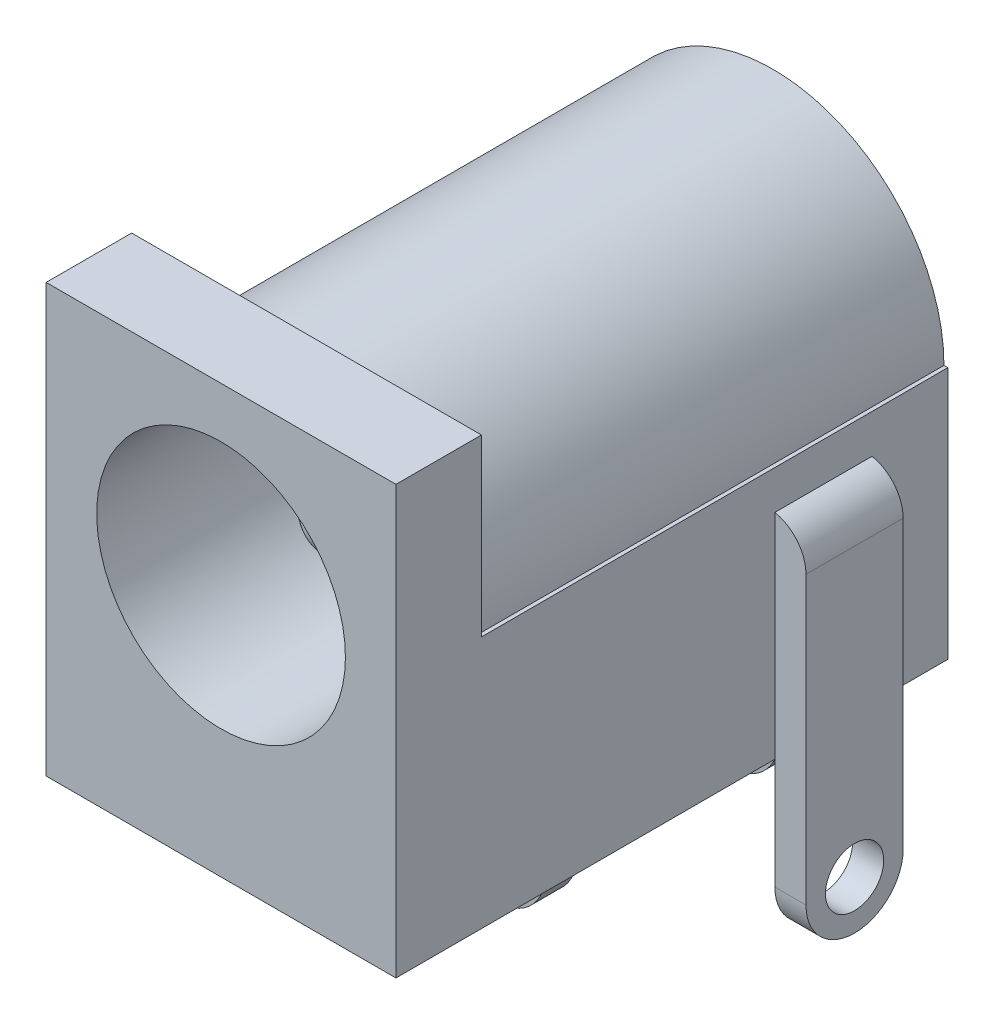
ISO-10303-21;
HEADER;
FILE_DESCRIPTION(('STEP AP214'),'2;1');
FILE_NAME('part.step','',(''),(''),'','','');
FILE_SCHEMA(('AUTOMOTIVE_DESIGN { 1 0 10303 214 1 1 1 1 }'));
ENDSEC;
DATA;
#1=APPLICATION_CONTEXT('core data for automotive mechanical design processes');
#2=APPLICATION_PROTOCOL_DEFINITION('international standard','automotive_design',2000,#1);
#3=PRODUCT_CONTEXT('',#1,'mechanical');
#4=PRODUCT('Part','Part','',(#3));
#5=PRODUCT_RELATED_PRODUCT_CATEGORY('part','',(#4));
#6=PRODUCT_DEFINITION_FORMATION('','',#4);
#7=PRODUCT_DEFINITION_CONTEXT('part definition',#1,'design');
#8=PRODUCT_DEFINITION('design','',#6,#7);
#9=PRODUCT_DEFINITION_SHAPE('','',#8);
#10=(LENGTH_UNIT() NAMED_UNIT(*) SI_UNIT(.MILLI.,.METRE.));
#11=(NAMED_UNIT(*) PLANE_ANGLE_UNIT() SI_UNIT($,.RADIAN.));
#12=(NAMED_UNIT(*) SI_UNIT($,.STERADIAN.) SOLID_ANGLE_UNIT());
#13=UNCERTAINTY_MEASURE_WITH_UNIT(LENGTH_MEASURE(1.E-05),#10,'distance_accuracy_value','');
#14=(GEOMETRIC_REPRESENTATION_CONTEXT(3) GLOBAL_UNCERTAINTY_ASSIGNED_CONTEXT((#13)) GLOBAL_UNIT_ASSIGNED_CONTEXT((#10,
#11,#12)) REPRESENTATION_CONTEXT('',''));
#15=CARTESIAN_POINT('',(0.,0.,0.));
#16=DIRECTION('',(0.,0.,1.));
#17=DIRECTION('',(1.,0.,0.));
#18=AXIS2_PLACEMENT_3D('',#15,#16,#17);
#19=CARTESIAN_POINT('',(0.,6.5,-11.2));
#20=DIRECTION('',(0.,0.,1.));
#21=DIRECTION('',(1.,0.,0.));
#22=AXIS2_PLACEMENT_3D('',#19,#20,#21);
#23=PLANE('',#22);
#24=CARTESIAN_POINT('',(0.,6.5,-11.2));
#25=DIRECTION('',(0.,0.,1.));
#26=DIRECTION('',(1.,0.,0.));
#27=AXIS2_PLACEMENT_3D('',#24,#25,#26);
#28=CIRCLE('',#27,3.2);
#29=CARTESIAN_POINT('',(3.2,6.5,-11.2));
#30=VERTEX_POINT('',#29);
#31=EDGE_CURVE('E432',#30,#30,#28,.T.);
#32=ORIENTED_EDGE('',*,*,#31,.T.);
#33=EDGE_LOOP('',(#32));
#34=FACE_BOUND('',#33,.T.);
#35=CARTESIAN_POINT('',(0.,6.5,-11.2));
#36=DIRECTION('',(0.,0.,1.));
#37=DIRECTION('',(1.,0.,0.));
#38=AXIS2_PLACEMENT_3D('',#35,#36,#37);
#39=CIRCLE('',#38,1.00555386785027);
#40=CARTESIAN_POINT('',(1.00555386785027,6.5,-11.2));
#41=VERTEX_POINT('',#40);
#42=EDGE_CURVE('E557',#41,#41,#39,.T.);
#43=ORIENTED_EDGE('',*,*,#42,.F.);
#44=EDGE_LOOP('',(#43));
#45=FACE_BOUND('',#44,.T.);
#46=ADVANCED_FACE('F39',(#34,#45),#23,.T.);
#47=CARTESIAN_POINT('',(-4.5,0.,-14.2));
#48=DIRECTION('',(0.,-1.,0.));
#49=DIRECTION('',(1.,0.,0.));
#50=AXIS2_PLACEMENT_3D('',#47,#48,#49);
#51=PLANE('',#50);
#52=DIRECTION('',(0.,0.,-1.));
#53=VECTOR('',#52,1.);
#54=CARTESIAN_POINT('',(-1.45,0.,-13.4));
#55=LINE('',#54,#53);
#56=CARTESIAN_POINT('',(-1.45,0.,-13.4));
#57=VERTEX_POINT('',#56);
#58=CARTESIAN_POINT('',(-1.45,0.,-14.2));
#59=VERTEX_POINT('',#58);
#60=EDGE_CURVE('E275',#57,#59,#55,.T.);
#61=ORIENTED_EDGE('',*,*,#60,.F.);
#62=DIRECTION('',(-1.,0.,0.));
#63=VECTOR('',#62,1.);
#64=CARTESIAN_POINT('',(0.,0.,-13.4));
#65=LINE('',#64,#63);
#66=CARTESIAN_POINT('',(-1.25,0.,-13.4));
#67=VERTEX_POINT('',#66);
#68=EDGE_CURVE('E540',#67,#57,#65,.T.);
#69=ORIENTED_EDGE('',*,*,#68,.F.);
#70=DIRECTION('',(0.,0.,1.));
#71=VECTOR('',#70,1.);
#72=CARTESIAN_POINT('',(-1.25,0.,-14.2));
#73=LINE('',#72,#71);
#74=CARTESIAN_POINT('',(-1.25,0.,-13.1));
#75=VERTEX_POINT('',#74);
#76=EDGE_CURVE('E64',#67,#75,#73,.T.);
#77=ORIENTED_EDGE('',*,*,#76,.T.);
#78=DIRECTION('',(-1.,0.,0.));
#79=VECTOR('',#78,1.);
#80=CARTESIAN_POINT('',(-4.5,0.,-13.1));
#81=LINE('',#80,#79);
#82=CARTESIAN_POINT('',(1.25,0.,-13.1));
#83=VERTEX_POINT('',#82);
#84=EDGE_CURVE('E49',#83,#75,#81,.T.);
#85=ORIENTED_EDGE('',*,*,#84,.F.);
#86=DIRECTION('',(0.,0.,-1.));
#87=VECTOR('',#86,1.);
#88=CARTESIAN_POINT('',(1.25,0.,-14.2));
#89=LINE('',#88,#87);
#90=CARTESIAN_POINT('',(1.25,0.,-13.4));
#91=VERTEX_POINT('',#90);
#92=EDGE_CURVE('E11',#83,#91,#89,.T.);
#93=ORIENTED_EDGE('',*,*,#92,.T.);
#94=CARTESIAN_POINT('',(1.45,0.,-13.4));
#95=VERTEX_POINT('',#94);
#96=EDGE_CURVE('E529',#95,#91,#65,.T.);
#97=ORIENTED_EDGE('',*,*,#96,.F.);
#98=DIRECTION('',(0.,0.,-1.));
#99=VECTOR('',#98,1.);
#100=CARTESIAN_POINT('',(1.45,0.,-13.4));
#101=LINE('',#100,#99);
#102=CARTESIAN_POINT('',(1.45,0.,-14.2));
#103=VERTEX_POINT('',#102);
#104=EDGE_CURVE('E255',#95,#103,#101,.T.);
#105=ORIENTED_EDGE('',*,*,#104,.T.);
#106=DIRECTION('',(1.,0.,0.));
#107=VECTOR('',#106,1.);
#108=CARTESIAN_POINT('',(-4.5,0.,-14.2));
#109=LINE('',#108,#107);
#110=CARTESIAN_POINT('',(4.5,0.,-14.2));
#111=VERTEX_POINT('',#110);
#112=EDGE_CURVE('E443',#103,#111,#109,.T.);
#113=ORIENTED_EDGE('',*,*,#112,.T.);
#114=DIRECTION('',(0.,0.,1.));
#115=VECTOR('',#114,1.);
#116=CARTESIAN_POINT('',(4.5,0.,-14.2));
#117=LINE('',#116,#115);
#118=CARTESIAN_POINT('',(4.5,0.,-12.25));
#119=VERTEX_POINT('',#118);
#120=EDGE_CURVE('E475',#111,#119,#117,.T.);
#121=ORIENTED_EDGE('',*,*,#120,.T.);
#122=CARTESIAN_POINT('',(4.5,0.,-9.75));
#123=VERTEX_POINT('',#122);
#124=EDGE_CURVE('E479',#119,#123,#117,.T.);
#125=ORIENTED_EDGE('',*,*,#124,.T.);
#126=CARTESIAN_POINT('',(4.5,0.,0.));
#127=VERTEX_POINT('',#126);
#128=EDGE_CURVE('E480',#123,#127,#117,.T.);
#129=ORIENTED_EDGE('',*,*,#128,.T.);
#130=DIRECTION('',(1.,0.,0.));
#131=VECTOR('',#130,1.);
#132=CARTESIAN_POINT('',(-4.5,0.,0.));
#133=LINE('',#132,#131);
#134=CARTESIAN_POINT('',(-4.5,0.,0.));
#135=VERTEX_POINT('',#134);
#136=EDGE_CURVE('E457',#135,#127,#133,.T.);
#137=ORIENTED_EDGE('',*,*,#136,.F.);
#138=DIRECTION('',(0.,0.,1.));
#139=VECTOR('',#138,1.);
#140=CARTESIAN_POINT('',(-4.5,0.,-14.2));
#141=LINE('',#140,#139);
#142=CARTESIAN_POINT('',(-4.5,0.,-14.2));
#143=VERTEX_POINT('',#142);
#144=EDGE_CURVE('E453',#143,#135,#141,.T.);
#145=ORIENTED_EDGE('',*,*,#144,.F.);
#146=EDGE_CURVE('E445',#143,#59,#109,.T.);
#147=ORIENTED_EDGE('',*,*,#146,.T.);
#148=EDGE_LOOP('',(#61,#69,#77,#85,#93,#97,#105,#113,#121,#125,#129,#137,#145,#147));
#149=FACE_BOUND('',#148,.T.);
#150=DIRECTION('',(-1.,0.,0.));
#151=VECTOR('',#150,1.);
#152=CARTESIAN_POINT('',(1.25,0.,-7.9));
#153=LINE('',#152,#151);
#154=CARTESIAN_POINT('',(1.25,0.,-7.9));
#155=VERTEX_POINT('',#154);
#156=CARTESIAN_POINT('',(-1.25,0.,-7.9));
#157=VERTEX_POINT('',#156);
#158=EDGE_CURVE('E310',#155,#157,#153,.T.);
#159=ORIENTED_EDGE('',*,*,#158,.T.);
#160=DIRECTION('',(0.,0.,-1.));
#161=VECTOR('',#160,1.);
#162=CARTESIAN_POINT('',(-1.25,0.,-7.1));
#163=LINE('',#162,#161);
#164=CARTESIAN_POINT('',(-1.25,0.,-7.1));
#165=VERTEX_POINT('',#164);
#166=EDGE_CURVE('E352',#165,#157,#163,.T.);
#167=ORIENTED_EDGE('',*,*,#166,.F.);
#168=DIRECTION('',(-1.,0.,0.));
#169=VECTOR('',#168,1.);
#170=CARTESIAN_POINT('',(1.25,0.,-7.1));
#171=LINE('',#170,#169);
#172=CARTESIAN_POINT('',(1.25,0.,-7.1));
#173=VERTEX_POINT('',#172);
#174=EDGE_CURVE('E314',#173,#165,#171,.T.);
#175=ORIENTED_EDGE('',*,*,#174,.F.);
#176=DIRECTION('',(0.,0.,-1.));
#177=VECTOR('',#176,1.);
#178=CARTESIAN_POINT('',(1.25,0.,-7.1));
#179=LINE('',#178,#177);
#180=EDGE_CURVE('E328',#173,#155,#179,.T.);
#181=ORIENTED_EDGE('',*,*,#180,.T.);
#182=EDGE_LOOP('',(#159,#167,#175,#181));
#183=FACE_BOUND('',#182,.T.);
#184=ADVANCED_FACE('F525',(#149,#183),#51,.T.);
#185=CARTESIAN_POINT('',(4.5,0.,-14.2));
#186=DIRECTION('',(1.,0.,0.));
#187=DIRECTION('',(0.,1.,0.));
#188=AXIS2_PLACEMENT_3D('',#185,#186,#187);
#189=PLANE('',#188);
#190=DIRECTION('',(0.,0.,-1.));
#191=VECTOR('',#190,1.);
#192=CARTESIAN_POINT('',(4.5,5.5,-9.75));
#193=LINE('',#192,#191);
#194=CARTESIAN_POINT('',(4.5,5.5,-9.75));
#195=VERTEX_POINT('',#194);
#196=CARTESIAN_POINT('',(4.5,5.5,-12.25));
#197=VERTEX_POINT('',#196);
#198=EDGE_CURVE('E373',#195,#197,#193,.T.);
#199=ORIENTED_EDGE('',*,*,#198,.T.);
#200=DIRECTION('',(0.,-1.,0.));
#201=VECTOR('',#200,1.);
#202=CARTESIAN_POINT('',(4.5,5.5,-12.25));
#203=LINE('',#202,#201);
#204=EDGE_CURVE('E374',#197,#119,#203,.T.);
#205=ORIENTED_EDGE('',*,*,#204,.T.);
#206=ORIENTED_EDGE('',*,*,#120,.F.);
#207=DIRECTION('',(0.,1.,0.));
#208=VECTOR('',#207,1.);
#209=CARTESIAN_POINT('',(4.5,0.,-14.2));
#210=LINE('',#209,#208);
#211=CARTESIAN_POINT('',(4.5,6.5,-14.2));
#212=VERTEX_POINT('',#211);
#213=EDGE_CURVE('E449',#111,#212,#210,.T.);
#214=ORIENTED_EDGE('',*,*,#213,.T.);
#215=DIRECTION('',(0.,0.,-1.));
#216=VECTOR('',#215,1.);
#217=CARTESIAN_POINT('',(4.5,6.5,-2.2));
#218=LINE('',#217,#216);
#219=CARTESIAN_POINT('',(4.5,6.5,-2.2));
#220=VERTEX_POINT('',#219);
#221=EDGE_CURVE('E409',#220,#212,#218,.T.);
#222=ORIENTED_EDGE('',*,*,#221,.F.);
#223=DIRECTION('',(0.,-1.,0.));
#224=VECTOR('',#223,1.);
#225=CARTESIAN_POINT('',(4.5,11.,-2.2));
#226=LINE('',#225,#224);
#227=CARTESIAN_POINT('',(4.5,11.,-2.2));
#228=VERTEX_POINT('',#227);
#229=EDGE_CURVE('E393',#228,#220,#226,.T.);
#230=ORIENTED_EDGE('',*,*,#229,.F.);
#231=DIRECTION('',(0.,0.,1.));
#232=VECTOR('',#231,1.);
#233=CARTESIAN_POINT('',(4.5,11.,-14.2));
#234=LINE('',#233,#232);
#235=CARTESIAN_POINT('',(4.5,11.,0.));
#236=VERTEX_POINT('',#235);
#237=EDGE_CURVE('E472',#228,#236,#234,.T.);
#238=ORIENTED_EDGE('',*,*,#237,.T.);
#239=DIRECTION('',(0.,1.,0.));
#240=VECTOR('',#239,1.);
#241=CARTESIAN_POINT('',(4.5,0.,0.));
#242=LINE('',#241,#240);
#243=EDGE_CURVE('E461',#127,#236,#242,.T.);
#244=ORIENTED_EDGE('',*,*,#243,.F.);
#245=ORIENTED_EDGE('',*,*,#128,.F.);
#246=DIRECTION('',(0.,-1.,0.));
#247=VECTOR('',#246,1.);
#248=CARTESIAN_POINT('',(4.5,5.5,-9.75));
#249=LINE('',#248,#247);
#250=EDGE_CURVE('E365',#195,#123,#249,.T.);
#251=ORIENTED_EDGE('',*,*,#250,.F.);
#252=EDGE_LOOP('',(#199,#205,#206,#214,#222,#230,#238,#244,#245,#251));
#253=FACE_BOUND('',#252,.T.);
#254=ADVANCED_FACE('F581',(#253),#189,.T.);
#255=CARTESIAN_POINT('',(-4.5,11.,-14.2));
#256=DIRECTION('',(0.,1.,0.));
#257=DIRECTION('',(0.,0.,1.));
#258=AXIS2_PLACEMENT_3D('',#255,#256,#257);
#259=PLANE('',#258);
#260=ORIENTED_EDGE('',*,*,#237,.F.);
#261=DIRECTION('',(1.,0.,0.));
#262=VECTOR('',#261,1.);
#263=CARTESIAN_POINT('',(4.5,11.,-2.2));
#264=LINE('',#263,#262);
#265=CARTESIAN_POINT('',(-4.5,11.,-2.2));
#266=VERTEX_POINT('',#265);
#267=EDGE_CURVE('E389',#266,#228,#264,.T.);
#268=ORIENTED_EDGE('',*,*,#267,.F.);
#269=DIRECTION('',(0.,0.,1.));
#270=VECTOR('',#269,1.);
#271=CARTESIAN_POINT('',(-4.5,11.,-14.2));
#272=LINE('',#271,#270);
#273=CARTESIAN_POINT('',(-4.5,11.,0.));
#274=VERTEX_POINT('',#273);
#275=EDGE_CURVE('E468',#266,#274,#272,.T.);
#276=ORIENTED_EDGE('',*,*,#275,.T.);
#277=DIRECTION('',(-1.,0.,0.));
#278=VECTOR('',#277,1.);
#279=CARTESIAN_POINT('',(-4.5,11.,0.));
#280=LINE('',#279,#278);
#281=EDGE_CURVE('E444',#236,#274,#280,.T.);
#282=ORIENTED_EDGE('',*,*,#281,.F.);
#283=EDGE_LOOP('',(#260,#268,#276,#282));
#284=FACE_BOUND('',#283,.T.);
#285=ADVANCED_FACE('F602',(#284),#259,.T.);
#286=CARTESIAN_POINT('',(-4.5,0.,-14.2));
#287=DIRECTION('',(-1.,0.,0.));
#288=DIRECTION('',(0.,0.,1.));
#289=AXIS2_PLACEMENT_3D('',#286,#287,#288);
#290=PLANE('',#289);
#291=DIRECTION('',(0.,0.,-1.));
#292=VECTOR('',#291,1.);
#293=CARTESIAN_POINT('',(-4.5,6.5,-2.2));
#294=LINE('',#293,#292);
#295=CARTESIAN_POINT('',(-4.5,6.5,-2.2));
#296=VERTEX_POINT('',#295);
#297=CARTESIAN_POINT('',(-4.5,6.5,-14.2));
#298=VERTEX_POINT('',#297);
#299=EDGE_CURVE('E419',#296,#298,#294,.T.);
#300=ORIENTED_EDGE('',*,*,#299,.T.);
#301=DIRECTION('',(0.,-1.,0.));
#302=VECTOR('',#301,1.);
#303=CARTESIAN_POINT('',(-4.5,0.,-14.2));
#304=LINE('',#303,#302);
#305=EDGE_CURVE('E440',#298,#143,#304,.T.);
#306=ORIENTED_EDGE('',*,*,#305,.T.);
#307=ORIENTED_EDGE('',*,*,#144,.T.);
#308=DIRECTION('',(0.,-1.,0.));
#309=VECTOR('',#308,1.);
#310=CARTESIAN_POINT('',(-4.5,0.,0.));
#311=LINE('',#310,#309);
#312=EDGE_CURVE('E436',#274,#135,#311,.T.);
#313=ORIENTED_EDGE('',*,*,#312,.F.);
#314=ORIENTED_EDGE('',*,*,#275,.F.);
#315=DIRECTION('',(0.,1.,0.));
#316=VECTOR('',#315,1.);
#317=CARTESIAN_POINT('',(-4.5,11.,-2.2));
#318=LINE('',#317,#316);
#319=EDGE_CURVE('E386',#296,#266,#318,.T.);
#320=ORIENTED_EDGE('',*,*,#319,.F.);
#321=EDGE_LOOP('',(#300,#306,#307,#313,#314,#320));
#322=FACE_BOUND('',#321,.T.);
#323=ADVANCED_FACE('F597',(#322),#290,.T.);
#324=CARTESIAN_POINT('',(0.,0.,-14.2));
#325=DIRECTION('',(0.,0.,-1.));
#326=DIRECTION('',(-1.,0.,0.));
#327=AXIS2_PLACEMENT_3D('',#324,#325,#326);
#328=PLANE('',#327);
#329=DIRECTION('',(0.,-1.,0.));
#330=VECTOR('',#329,1.);
#331=CARTESIAN_POINT('',(1.45,0.,-14.2));
#332=LINE('',#331,#330);
#333=CARTESIAN_POINT('',(1.45,5.83045150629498,-14.2));
#334=VERTEX_POINT('',#333);
#335=EDGE_CURVE('E267',#334,#103,#332,.T.);
#336=ORIENTED_EDGE('',*,*,#335,.F.);
#337=CARTESIAN_POINT('',(0.,7.43377496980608,-14.2));
#338=DIRECTION('',(0.,0.,-1.));
#339=DIRECTION('',(-1.,0.,0.));
#340=AXIS2_PLACEMENT_3D('',#337,#338,#339);
#341=CIRCLE('',#340,2.16174608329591);
#342=CARTESIAN_POINT('',(-1.45,5.83045150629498,-14.2));
#343=VERTEX_POINT('',#342);
#344=EDGE_CURVE('E653',#343,#334,#341,.T.);
#345=ORIENTED_EDGE('',*,*,#344,.F.);
#346=DIRECTION('',(0.,1.,0.));
#347=VECTOR('',#346,1.);
#348=CARTESIAN_POINT('',(-1.45,0.,-14.2));
#349=LINE('',#348,#347);
#350=EDGE_CURVE('E247',#59,#343,#349,.T.);
#351=ORIENTED_EDGE('',*,*,#350,.F.);
#352=ORIENTED_EDGE('',*,*,#146,.F.);
#353=ORIENTED_EDGE('',*,*,#305,.F.);
#354=DIRECTION('',(-1.,0.,0.));
#355=VECTOR('',#354,1.);
#356=CARTESIAN_POINT('',(-4.4,6.5,-14.2));
#357=LINE('',#356,#355);
#358=CARTESIAN_POINT('',(-4.4,6.5,-14.2));
#359=VERTEX_POINT('',#358);
#360=EDGE_CURVE('E390',#359,#298,#357,.T.);
#361=ORIENTED_EDGE('',*,*,#360,.F.);
#362=CARTESIAN_POINT('',(0.,6.5,-14.2));
#363=DIRECTION('',(0.,0.,1.));
#364=DIRECTION('',(-1.,0.,0.));
#365=AXIS2_PLACEMENT_3D('',#362,#363,#364);
#366=CIRCLE('',#365,4.4);
#367=CARTESIAN_POINT('',(4.4,6.5,-14.2));
#368=VERTEX_POINT('',#367);
#369=EDGE_CURVE('E413',#368,#359,#366,.T.);
#370=ORIENTED_EDGE('',*,*,#369,.F.);
#371=DIRECTION('',(-1.,0.,0.));
#372=VECTOR('',#371,1.);
#373=CARTESIAN_POINT('',(4.5,6.5,-14.2));
#374=LINE('',#373,#372);
#375=EDGE_CURVE('E385',#212,#368,#374,.T.);
#376=ORIENTED_EDGE('',*,*,#375,.F.);
#377=ORIENTED_EDGE('',*,*,#213,.F.);
#378=ORIENTED_EDGE('',*,*,#112,.F.);
#379=EDGE_LOOP('',(#336,#345,#351,#352,#353,#361,#370,#376,#377,#378));
#380=FACE_BOUND('',#379,.T.);
#381=ADVANCED_FACE('F594',(#380),#328,.T.);
#382=CARTESIAN_POINT('',(0.,0.,0.));
#383=DIRECTION('',(0.,0.,-1.));
#384=DIRECTION('',(-1.,0.,0.));
#385=AXIS2_PLACEMENT_3D('',#382,#383,#384);
#386=PLANE('',#385);
#387=CARTESIAN_POINT('',(0.,6.5,0.));
#388=DIRECTION('',(0.,0.,1.));
#389=DIRECTION('',(1.,0.,0.));
#390=AXIS2_PLACEMENT_3D('',#387,#388,#389);
#391=CIRCLE('',#390,3.2);
#392=CARTESIAN_POINT('',(3.2,6.5,0.));
#393=VERTEX_POINT('',#392);
#394=EDGE_CURVE('E423',#393,#393,#391,.T.);
#395=ORIENTED_EDGE('',*,*,#394,.F.);
#396=EDGE_LOOP('',(#395));
#397=FACE_BOUND('',#396,.T.);
#398=ORIENTED_EDGE('',*,*,#312,.T.);
#399=ORIENTED_EDGE('',*,*,#136,.T.);
#400=ORIENTED_EDGE('',*,*,#243,.T.);
#401=ORIENTED_EDGE('',*,*,#281,.T.);
#402=EDGE_LOOP('',(#398,#399,#400,#401));
#403=FACE_BOUND('',#402,.T.);
#404=ADVANCED_FACE('F592',(#397,#403),#386,.F.);
#405=CARTESIAN_POINT('',(0.,6.5,-11.2));
#406=DIRECTION('',(0.,0.,1.));
#407=DIRECTION('',(1.,0.,0.));
#408=AXIS2_PLACEMENT_3D('',#405,#406,#407);
#409=CYLINDRICAL_SURFACE('',#408,3.2);
#410=ORIENTED_EDGE('',*,*,#31,.F.);
#411=EDGE_LOOP('',(#410));
#412=FACE_BOUND('',#411,.T.);
#413=ORIENTED_EDGE('',*,*,#394,.T.);
#414=EDGE_LOOP('',(#413));
#415=FACE_BOUND('',#414,.T.);
#416=ADVANCED_FACE('F588',(#412,#415),#409,.F.);
#417=CARTESIAN_POINT('',(-4.4,6.5,-2.2));
#418=DIRECTION('',(0.,-1.,0.));
#419=DIRECTION('',(0.,0.,-1.));
#420=AXIS2_PLACEMENT_3D('',#417,#418,#419);
#421=PLANE('',#420);
#422=ORIENTED_EDGE('',*,*,#360,.T.);
#423=ORIENTED_EDGE('',*,*,#299,.F.);
#424=DIRECTION('',(-1.,0.,0.));
#425=VECTOR('',#424,1.);
#426=CARTESIAN_POINT('',(-4.4,6.5,-2.2));
#427=LINE('',#426,#425);
#428=CARTESIAN_POINT('',(-4.4,6.5,-2.2));
#429=VERTEX_POINT('',#428);
#430=EDGE_CURVE('E405',#429,#296,#427,.T.);
#431=ORIENTED_EDGE('',*,*,#430,.F.);
#432=DIRECTION('',(0.,0.,-1.));
#433=VECTOR('',#432,1.);
#434=CARTESIAN_POINT('',(-4.4,6.5,-2.2));
#435=LINE('',#434,#433);
#436=EDGE_CURVE('E424',#429,#359,#435,.T.);
#437=ORIENTED_EDGE('',*,*,#436,.T.);
#438=EDGE_LOOP('',(#422,#423,#431,#437));
#439=FACE_BOUND('',#438,.T.);
#440=ADVANCED_FACE('F591',(#439),#421,.F.);
#441=CARTESIAN_POINT('',(0.,6.5,-2.2));
#442=DIRECTION('',(0.,0.,-1.));
#443=DIRECTION('',(-1.,0.,0.));
#444=AXIS2_PLACEMENT_3D('',#441,#442,#443);
#445=CYLINDRICAL_SURFACE('',#444,4.4);
#446=ORIENTED_EDGE('',*,*,#369,.T.);
#447=ORIENTED_EDGE('',*,*,#436,.F.);
#448=CARTESIAN_POINT('',(0.,6.5,-2.2));
#449=DIRECTION('',(0.,0.,1.));
#450=DIRECTION('',(-1.,0.,0.));
#451=AXIS2_PLACEMENT_3D('',#448,#449,#450);
#452=CIRCLE('',#451,4.4);
#453=CARTESIAN_POINT('',(4.4,6.5,-2.2));
#454=VERTEX_POINT('',#453);
#455=EDGE_CURVE('E401',#454,#429,#452,.T.);
#456=ORIENTED_EDGE('',*,*,#455,.F.);
#457=DIRECTION('',(0.,0.,-1.));
#458=VECTOR('',#457,1.);
#459=CARTESIAN_POINT('',(4.4,6.5,-2.2));
#460=LINE('',#459,#458);
#461=EDGE_CURVE('E427',#454,#368,#460,.T.);
#462=ORIENTED_EDGE('',*,*,#461,.T.);
#463=EDGE_LOOP('',(#446,#447,#456,#462));
#464=FACE_BOUND('',#463,.T.);
#465=ADVANCED_FACE('F698',(#464),#445,.T.);
#466=CARTESIAN_POINT('',(4.5,6.5,-2.2));
#467=DIRECTION('',(0.,-1.,0.));
#468=DIRECTION('',(0.,0.,-1.));
#469=AXIS2_PLACEMENT_3D('',#466,#467,#468);
#470=PLANE('',#469);
#471=ORIENTED_EDGE('',*,*,#375,.T.);
#472=ORIENTED_EDGE('',*,*,#461,.F.);
#473=DIRECTION('',(-1.,0.,0.));
#474=VECTOR('',#473,1.);
#475=CARTESIAN_POINT('',(4.5,6.5,-2.2));
#476=LINE('',#475,#474);
#477=EDGE_CURVE('E397',#220,#454,#476,.T.);
#478=ORIENTED_EDGE('',*,*,#477,.F.);
#479=ORIENTED_EDGE('',*,*,#221,.T.);
#480=EDGE_LOOP('',(#471,#472,#478,#479));
#481=FACE_BOUND('',#480,.T.);
#482=ADVANCED_FACE('F586',(#481),#470,.F.);
#483=CARTESIAN_POINT('',(0.,6.5,-2.2));
#484=DIRECTION('',(0.,0.,-1.));
#485=DIRECTION('',(-1.,0.,0.));
#486=AXIS2_PLACEMENT_3D('',#483,#484,#485);
#487=PLANE('',#486);
#488=ORIENTED_EDGE('',*,*,#319,.T.);
#489=ORIENTED_EDGE('',*,*,#267,.T.);
#490=ORIENTED_EDGE('',*,*,#229,.T.);
#491=ORIENTED_EDGE('',*,*,#477,.T.);
#492=ORIENTED_EDGE('',*,*,#455,.T.);
#493=ORIENTED_EDGE('',*,*,#430,.T.);
#494=EDGE_LOOP('',(#488,#489,#490,#491,#492,#493));
#495=FACE_BOUND('',#494,.T.);
#496=ADVANCED_FACE('F683',(#495),#487,.T.);
#497=CARTESIAN_POINT('',(4.5,5.5,-9.75));
#498=DIRECTION('',(1.,0.,0.));
#499=DIRECTION('',(0.,1.,0.));
#500=AXIS2_PLACEMENT_3D('',#497,#498,#499);
#501=PLANE('',#500);
#502=CARTESIAN_POINT('',(4.5,-2.85,-11.));
#503=DIRECTION('',(1.,0.,0.));
#504=DIRECTION('',(0.,1.,0.));
#505=AXIS2_PLACEMENT_3D('',#502,#503,#504);
#506=CIRCLE('',#505,0.75);
#507=CARTESIAN_POINT('',(4.5,-2.1,-11.));
#508=VERTEX_POINT('',#507);
#509=EDGE_CURVE('E360',#508,#508,#506,.F.);
#510=ORIENTED_EDGE('',*,*,#509,.F.);
#511=EDGE_LOOP('',(#510));
#512=FACE_BOUND('',#511,.T.);
#513=CARTESIAN_POINT('',(4.5,-2.85,-12.25));
#514=VERTEX_POINT('',#513);
#515=EDGE_CURVE('E379',#119,#514,#203,.T.);
#516=ORIENTED_EDGE('',*,*,#515,.T.);
#517=CARTESIAN_POINT('',(4.5,-2.85,-11.));
#518=DIRECTION('',(1.,0.,0.));
#519=DIRECTION('',(0.,1.,0.));
#520=AXIS2_PLACEMENT_3D('',#517,#518,#519);
#521=CIRCLE('',#520,1.25);
#522=CARTESIAN_POINT('',(4.5,-4.1,-11.));
#523=VERTEX_POINT('',#522);
#524=EDGE_CURVE('E506',#514,#523,#521,.F.);
#525=ORIENTED_EDGE('',*,*,#524,.T.);
#526=CARTESIAN_POINT('',(4.5,-2.85,-11.));
#527=DIRECTION('',(1.,0.,0.));
#528=DIRECTION('',(0.,1.,0.));
#529=AXIS2_PLACEMENT_3D('',#526,#527,#528);
#530=CIRCLE('',#529,1.25);
#531=CARTESIAN_POINT('',(4.5,-2.85,-9.75));
#532=VERTEX_POINT('',#531);
#533=EDGE_CURVE('E503',#523,#532,#530,.F.);
#534=ORIENTED_EDGE('',*,*,#533,.T.);
#535=EDGE_CURVE('E370',#123,#532,#249,.T.);
#536=ORIENTED_EDGE('',*,*,#535,.F.);
#537=ORIENTED_EDGE('',*,*,#124,.F.);
#538=EDGE_LOOP('',(#516,#525,#534,#536,#537));
#539=FACE_BOUND('',#538,.T.);
#540=ADVANCED_FACE('F679',(#512,#539),#501,.F.);
#541=CARTESIAN_POINT('',(5.3,5.5,-9.75));
#542=DIRECTION('',(-1.,0.,0.));
#543=DIRECTION('',(0.,-1.,0.));
#544=AXIS2_PLACEMENT_3D('',#541,#542,#543);
#545=PLANE('',#544);
#546=CARTESIAN_POINT('',(5.3,-2.85,-11.));
#547=DIRECTION('',(1.,0.,0.));
#548=DIRECTION('',(0.,1.,0.));
#549=AXIS2_PLACEMENT_3D('',#546,#547,#548);
#550=CIRCLE('',#549,0.75);
#551=CARTESIAN_POINT('',(5.3,-2.1,-11.));
#552=VERTEX_POINT('',#551);
#553=EDGE_CURVE('E356',#552,#552,#550,.T.);
#554=ORIENTED_EDGE('',*,*,#553,.F.);
#555=EDGE_LOOP('',(#554));
#556=FACE_BOUND('',#555,.T.);
#557=CARTESIAN_POINT('',(5.3,-2.85,-11.));
#558=DIRECTION('',(-1.,0.,0.));
#559=DIRECTION('',(0.,-1.,0.));
#560=AXIS2_PLACEMENT_3D('',#557,#558,#559);
#561=CIRCLE('',#560,1.25);
#562=CARTESIAN_POINT('',(5.3,-2.85,-9.75));
#563=VERTEX_POINT('',#562);
#564=CARTESIAN_POINT('',(5.3,-4.1,-11.));
#565=VERTEX_POINT('',#564);
#566=EDGE_CURVE('E493',#563,#565,#561,.F.);
#567=ORIENTED_EDGE('',*,*,#566,.T.);
#568=CARTESIAN_POINT('',(5.3,-2.85,-11.));
#569=DIRECTION('',(-1.,0.,0.));
#570=DIRECTION('',(0.,-1.,0.));
#571=AXIS2_PLACEMENT_3D('',#568,#569,#570);
#572=CIRCLE('',#571,1.25);
#573=CARTESIAN_POINT('',(5.3,-2.85,-12.25));
#574=VERTEX_POINT('',#573);
#575=EDGE_CURVE('E496',#565,#574,#572,.F.);
#576=ORIENTED_EDGE('',*,*,#575,.T.);
#577=DIRECTION('',(0.,1.,0.));
#578=VECTOR('',#577,1.);
#579=CARTESIAN_POINT('',(5.3,5.5,-12.25));
#580=LINE('',#579,#578);
#581=CARTESIAN_POINT('',(5.3,4.52020410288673,-12.25));
#582=VERTEX_POINT('',#581);
#583=EDGE_CURVE('E378',#574,#582,#580,.T.);
#584=ORIENTED_EDGE('',*,*,#583,.T.);
#585=DIRECTION('',(0.,0.,1.));
#586=VECTOR('',#585,1.);
#587=CARTESIAN_POINT('',(5.3,4.52020410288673,-9.75));
#588=LINE('',#587,#586);
#589=CARTESIAN_POINT('',(5.3,4.52020410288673,-9.75));
#590=VERTEX_POINT('',#589);
#591=EDGE_CURVE('E486',#582,#590,#588,.T.);
#592=ORIENTED_EDGE('',*,*,#591,.T.);
#593=DIRECTION('',(0.,1.,0.));
#594=VECTOR('',#593,1.);
#595=CARTESIAN_POINT('',(5.3,5.5,-9.75));
#596=LINE('',#595,#594);
#597=EDGE_CURVE('E369',#563,#590,#596,.T.);
#598=ORIENTED_EDGE('',*,*,#597,.F.);
#599=EDGE_LOOP('',(#567,#576,#584,#592,#598));
#600=FACE_BOUND('',#599,.T.);
#601=ADVANCED_FACE('F635',(#556,#600),#545,.F.);
#602=CARTESIAN_POINT('',(0.,0.,-9.75));
#603=DIRECTION('',(0.,0.,1.));
#604=DIRECTION('',(1.,0.,0.));
#605=AXIS2_PLACEMENT_3D('',#602,#603,#604);
#606=PLANE('',#605);
#607=ORIENTED_EDGE('',*,*,#535,.T.);
#608=DIRECTION('',(1.,0.,0.));
#609=VECTOR('',#608,1.);
#610=CARTESIAN_POINT('',(5.3,-2.85,-9.75));
#611=LINE('',#610,#609);
#612=EDGE_CURVE('E509',#532,#563,#611,.T.);
#613=ORIENTED_EDGE('',*,*,#612,.T.);
#614=ORIENTED_EDGE('',*,*,#597,.T.);
#615=CARTESIAN_POINT('',(4.3,4.52020410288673,-9.75));
#616=DIRECTION('',(0.,0.,1.));
#617=DIRECTION('',(1.,0.,0.));
#618=AXIS2_PLACEMENT_3D('',#615,#616,#617);
#619=CIRCLE('',#618,1.);
#620=EDGE_CURVE('E490',#590,#195,#619,.T.);
#621=ORIENTED_EDGE('',*,*,#620,.T.);
#622=ORIENTED_EDGE('',*,*,#250,.T.);
#623=EDGE_LOOP('',(#607,#613,#614,#621,#622));
#624=FACE_BOUND('',#623,.T.);
#625=ADVANCED_FACE('F633',(#624),#606,.T.);
#626=CARTESIAN_POINT('',(0.,0.,-12.25));
#627=DIRECTION('',(0.,0.,1.));
#628=DIRECTION('',(1.,0.,0.));
#629=AXIS2_PLACEMENT_3D('',#626,#627,#628);
#630=PLANE('',#629);
#631=ORIENTED_EDGE('',*,*,#583,.F.);
#632=DIRECTION('',(1.,0.,0.));
#633=VECTOR('',#632,1.);
#634=CARTESIAN_POINT('',(0.,-2.85,-12.25));
#635=LINE('',#634,#633);
#636=EDGE_CURVE('E499',#574,#514,#635,.F.);
#637=ORIENTED_EDGE('',*,*,#636,.T.);
#638=ORIENTED_EDGE('',*,*,#515,.F.);
#639=ORIENTED_EDGE('',*,*,#204,.F.);
#640=CARTESIAN_POINT('',(4.3,4.52020410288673,-12.25));
#641=DIRECTION('',(0.,0.,1.));
#642=DIRECTION('',(1.,0.,0.));
#643=AXIS2_PLACEMENT_3D('',#640,#641,#642);
#644=CIRCLE('',#643,1.);
#645=EDGE_CURVE('E471',#197,#582,#644,.F.);
#646=ORIENTED_EDGE('',*,*,#645,.T.);
#647=EDGE_LOOP('',(#631,#637,#638,#639,#646));
#648=FACE_BOUND('',#647,.T.);
#649=ADVANCED_FACE('F616',(#648),#630,.F.);
#650=CARTESIAN_POINT('',(4.3,4.52020410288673,-9.75));
#651=DIRECTION('',(0.,0.,1.));
#652=DIRECTION('',(1.,0.,0.));
#653=AXIS2_PLACEMENT_3D('',#650,#651,#652);
#654=CYLINDRICAL_SURFACE('',#653,1.);
#655=ORIENTED_EDGE('',*,*,#620,.F.);
#656=ORIENTED_EDGE('',*,*,#591,.F.);
#657=ORIENTED_EDGE('',*,*,#645,.F.);
#658=ORIENTED_EDGE('',*,*,#198,.F.);
#659=EDGE_LOOP('',(#655,#656,#657,#658));
#660=FACE_BOUND('',#659,.T.);
#661=ADVANCED_FACE('F612',(#660),#654,.T.);
#662=CARTESIAN_POINT('',(0.,-2.85,-11.));
#663=DIRECTION('',(-1.,0.,0.));
#664=DIRECTION('',(0.,0.,1.));
#665=AXIS2_PLACEMENT_3D('',#662,#663,#664);
#666=CYLINDRICAL_SURFACE('',#665,1.25);
#667=ORIENTED_EDGE('',*,*,#612,.F.);
#668=ORIENTED_EDGE('',*,*,#533,.F.);
#669=DIRECTION('',(1.,0.,0.));
#670=VECTOR('',#669,1.);
#671=CARTESIAN_POINT('',(4.5,-4.1,-11.));
#672=LINE('',#671,#670);
#673=EDGE_CURVE('E364',#565,#523,#672,.F.);
#674=ORIENTED_EDGE('',*,*,#673,.F.);
#675=ORIENTED_EDGE('',*,*,#566,.F.);
#676=EDGE_LOOP('',(#667,#668,#674,#675));
#677=FACE_BOUND('',#676,.T.);
#678=ADVANCED_FACE('F615',(#677),#666,.T.);
#679=CARTESIAN_POINT('',(4.5,-2.85,-11.));
#680=DIRECTION('',(1.,0.,0.));
#681=DIRECTION('',(0.,0.,-1.));
#682=AXIS2_PLACEMENT_3D('',#679,#680,#681);
#683=CYLINDRICAL_SURFACE('',#682,1.25);
#684=ORIENTED_EDGE('',*,*,#524,.F.);
#685=ORIENTED_EDGE('',*,*,#636,.F.);
#686=ORIENTED_EDGE('',*,*,#575,.F.);
#687=ORIENTED_EDGE('',*,*,#673,.T.);
#688=EDGE_LOOP('',(#684,#685,#686,#687));
#689=FACE_BOUND('',#688,.T.);
#690=ADVANCED_FACE('F618',(#689),#683,.T.);
#691=CARTESIAN_POINT('',(-4.501,-2.85,-11.));
#692=DIRECTION('',(1.,0.,0.));
#693=DIRECTION('',(0.,1.,0.));
#694=AXIS2_PLACEMENT_3D('',#691,#692,#693);
#695=CYLINDRICAL_SURFACE('',#694,0.75);
#696=ORIENTED_EDGE('',*,*,#553,.T.);
#697=EDGE_LOOP('',(#696));
#698=FACE_BOUND('',#697,.T.);
#699=ORIENTED_EDGE('',*,*,#509,.T.);
#700=EDGE_LOOP('',(#699));
#701=FACE_BOUND('',#700,.T.);
#702=ADVANCED_FACE('F620',(#698,#701),#695,.F.);
#703=CARTESIAN_POINT('',(0.,-2.85,-7.1));
#704=DIRECTION('',(0.,0.,1.));
#705=DIRECTION('',(1.,0.,0.));
#706=AXIS2_PLACEMENT_3D('',#703,#704,#705);
#707=PLANE('',#706);
#708=ORIENTED_EDGE('',*,*,#174,.T.);
#709=DIRECTION('',(0.,-1.,0.));
#710=VECTOR('',#709,1.);
#711=CARTESIAN_POINT('',(-1.25,0.,-7.1));
#712=LINE('',#711,#710);
#713=CARTESIAN_POINT('',(-1.25,-2.85,-7.1));
#714=VERTEX_POINT('',#713);
#715=EDGE_CURVE('E318',#165,#714,#712,.T.);
#716=ORIENTED_EDGE('',*,*,#715,.T.);
#717=CARTESIAN_POINT('',(0.,-2.85,-7.1));
#718=DIRECTION('',(0.,0.,1.));
#719=DIRECTION('',(1.,0.,0.));
#720=AXIS2_PLACEMENT_3D('',#717,#718,#719);
#721=CIRCLE('',#720,1.25);
#722=CARTESIAN_POINT('',(1.25,-2.85,-7.1));
#723=VERTEX_POINT('',#722);
#724=EDGE_CURVE('E322',#714,#723,#721,.T.);
#725=ORIENTED_EDGE('',*,*,#724,.T.);
#726=DIRECTION('',(0.,1.,0.));
#727=VECTOR('',#726,1.);
#728=CARTESIAN_POINT('',(1.25,-2.85,-7.1));
#729=LINE('',#728,#727);
#730=EDGE_CURVE('E325',#723,#173,#729,.T.);
#731=ORIENTED_EDGE('',*,*,#730,.T.);
#732=EDGE_LOOP('',(#708,#716,#725,#731));
#733=FACE_BOUND('',#732,.T.);
#734=CARTESIAN_POINT('',(0.,-2.85,-7.1));
#735=DIRECTION('',(0.,0.,1.));
#736=DIRECTION('',(1.,0.,0.));
#737=AXIS2_PLACEMENT_3D('',#734,#735,#736);
#738=CIRCLE('',#737,0.75);
#739=CARTESIAN_POINT('',(0.75,-2.85,-7.1));
#740=VERTEX_POINT('',#739);
#741=EDGE_CURVE('E306',#740,#740,#738,.T.);
#742=ORIENTED_EDGE('',*,*,#741,.F.);
#743=EDGE_LOOP('',(#742));
#744=FACE_BOUND('',#743,.T.);
#745=ADVANCED_FACE('F751',(#733,#744),#707,.T.);
#746=CARTESIAN_POINT('',(0.,-2.85,-7.9));
#747=DIRECTION('',(0.,0.,1.));
#748=DIRECTION('',(1.,0.,0.));
#749=AXIS2_PLACEMENT_3D('',#746,#747,#748);
#750=PLANE('',#749);
#751=ORIENTED_EDGE('',*,*,#158,.F.);
#752=DIRECTION('',(0.,1.,0.));
#753=VECTOR('',#752,1.);
#754=CARTESIAN_POINT('',(1.25,-2.85,-7.9));
#755=LINE('',#754,#753);
#756=CARTESIAN_POINT('',(1.25,-2.85,-7.9));
#757=VERTEX_POINT('',#756);
#758=EDGE_CURVE('E319',#757,#155,#755,.T.);
#759=ORIENTED_EDGE('',*,*,#758,.F.);
#760=CARTESIAN_POINT('',(0.,-2.85,-7.9));
#761=DIRECTION('',(0.,0.,1.));
#762=DIRECTION('',(1.,0.,0.));
#763=AXIS2_PLACEMENT_3D('',#760,#761,#762);
#764=CIRCLE('',#763,1.25);
#765=CARTESIAN_POINT('',(-1.25,-2.85,-7.9));
#766=VERTEX_POINT('',#765);
#767=EDGE_CURVE('E335',#766,#757,#764,.T.);
#768=ORIENTED_EDGE('',*,*,#767,.F.);
#769=DIRECTION('',(0.,-1.,0.));
#770=VECTOR('',#769,1.);
#771=CARTESIAN_POINT('',(-1.25,0.,-7.9));
#772=LINE('',#771,#770);
#773=EDGE_CURVE('E332',#157,#766,#772,.T.);
#774=ORIENTED_EDGE('',*,*,#773,.F.);
#775=EDGE_LOOP('',(#751,#759,#768,#774));
#776=FACE_BOUND('',#775,.T.);
#777=CARTESIAN_POINT('',(0.,-2.85,-7.9));
#778=DIRECTION('',(0.,0.,1.));
#779=DIRECTION('',(1.,0.,0.));
#780=AXIS2_PLACEMENT_3D('',#777,#778,#779);
#781=CIRCLE('',#780,0.75);
#782=CARTESIAN_POINT('',(0.75,-2.85,-7.9));
#783=VERTEX_POINT('',#782);
#784=EDGE_CURVE('E305',#783,#783,#781,.T.);
#785=ORIENTED_EDGE('',*,*,#784,.T.);
#786=EDGE_LOOP('',(#785));
#787=FACE_BOUND('',#786,.T.);
#788=ADVANCED_FACE('F754',(#776,#787),#750,.F.);
#789=CARTESIAN_POINT('',(-1.25,0.,-7.1));
#790=DIRECTION('',(1.,0.,0.));
#791=DIRECTION('',(0.,1.,0.));
#792=AXIS2_PLACEMENT_3D('',#789,#790,#791);
#793=PLANE('',#792);
#794=ORIENTED_EDGE('',*,*,#773,.T.);
#795=DIRECTION('',(0.,0.,-1.));
#796=VECTOR('',#795,1.);
#797=CARTESIAN_POINT('',(-1.25,-2.85,-7.1));
#798=LINE('',#797,#796);
#799=EDGE_CURVE('E348',#714,#766,#798,.T.);
#800=ORIENTED_EDGE('',*,*,#799,.F.);
#801=ORIENTED_EDGE('',*,*,#715,.F.);
#802=ORIENTED_EDGE('',*,*,#166,.T.);
#803=EDGE_LOOP('',(#794,#800,#801,#802));
#804=FACE_BOUND('',#803,.T.);
#805=ADVANCED_FACE('F758',(#804),#793,.F.);
#806=CARTESIAN_POINT('',(0.,-2.85,-7.1));
#807=DIRECTION('',(0.,0.,-1.));
#808=DIRECTION('',(-1.,0.,0.));
#809=AXIS2_PLACEMENT_3D('',#806,#807,#808);
#810=CYLINDRICAL_SURFACE('',#809,1.25);
#811=ORIENTED_EDGE('',*,*,#767,.T.);
#812=DIRECTION('',(0.,0.,-1.));
#813=VECTOR('',#812,1.);
#814=CARTESIAN_POINT('',(1.25,-2.85,-7.1));
#815=LINE('',#814,#813);
#816=EDGE_CURVE('E344',#723,#757,#815,.T.);
#817=ORIENTED_EDGE('',*,*,#816,.F.);
#818=ORIENTED_EDGE('',*,*,#724,.F.);
#819=ORIENTED_EDGE('',*,*,#799,.T.);
#820=EDGE_LOOP('',(#811,#817,#818,#819));
#821=FACE_BOUND('',#820,.T.);
#822=ADVANCED_FACE('F762',(#821),#810,.T.);
#823=CARTESIAN_POINT('',(1.25,-2.85,-7.1));
#824=DIRECTION('',(-1.,0.,0.));
#825=DIRECTION('',(0.,0.,1.));
#826=AXIS2_PLACEMENT_3D('',#823,#824,#825);
#827=PLANE('',#826);
#828=ORIENTED_EDGE('',*,*,#758,.T.);
#829=ORIENTED_EDGE('',*,*,#180,.F.);
#830=ORIENTED_EDGE('',*,*,#730,.F.);
#831=ORIENTED_EDGE('',*,*,#816,.T.);
#832=EDGE_LOOP('',(#828,#829,#830,#831));
#833=FACE_BOUND('',#832,.T.);
#834=ADVANCED_FACE('F749',(#833),#827,.F.);
#835=CARTESIAN_POINT('',(0.,-2.85,-7.1));
#836=DIRECTION('',(0.,0.,-1.));
#837=DIRECTION('',(-1.,0.,0.));
#838=AXIS2_PLACEMENT_3D('',#835,#836,#837);
#839=CYLINDRICAL_SURFACE('',#838,0.75);
#840=ORIENTED_EDGE('',*,*,#741,.T.);
#841=EDGE_LOOP('',(#840));
#842=FACE_BOUND('',#841,.T.);
#843=ORIENTED_EDGE('',*,*,#784,.F.);
#844=EDGE_LOOP('',(#843));
#845=FACE_BOUND('',#844,.T.);
#846=ADVANCED_FACE('F736',(#842,#845),#839,.F.);
#847=CARTESIAN_POINT('',(0.,-2.85,-13.1));
#848=DIRECTION('',(0.,0.,1.));
#849=DIRECTION('',(1.,0.,0.));
#850=AXIS2_PLACEMENT_3D('',#847,#848,#849);
#851=PLANE('',#850);
#852=DIRECTION('',(0.,1.,0.));
#853=VECTOR('',#852,1.);
#854=CARTESIAN_POINT('',(1.25,-2.85,-13.1));
#855=LINE('',#854,#853);
#856=CARTESIAN_POINT('',(1.25,-2.85,-13.1));
#857=VERTEX_POINT('',#856);
#858=EDGE_CURVE('E291',#857,#83,#855,.T.);
#859=ORIENTED_EDGE('',*,*,#858,.T.);
#860=ORIENTED_EDGE('',*,*,#84,.T.);
#861=DIRECTION('',(0.,-1.,0.));
#862=VECTOR('',#861,1.);
#863=CARTESIAN_POINT('',(-1.25,0.,-13.1));
#864=LINE('',#863,#862);
#865=CARTESIAN_POINT('',(-1.25,-2.85,-13.1));
#866=VERTEX_POINT('',#865);
#867=EDGE_CURVE('E285',#75,#866,#864,.T.);
#868=ORIENTED_EDGE('',*,*,#867,.T.);
#869=CARTESIAN_POINT('',(0.,-2.85,-13.1));
#870=DIRECTION('',(0.,0.,1.));
#871=DIRECTION('',(1.,0.,0.));
#872=AXIS2_PLACEMENT_3D('',#869,#870,#871);
#873=CIRCLE('',#872,1.25);
#874=EDGE_CURVE('E288',#866,#857,#873,.T.);
#875=ORIENTED_EDGE('',*,*,#874,.T.);
#876=EDGE_LOOP('',(#859,#860,#868,#875));
#877=FACE_BOUND('',#876,.T.);
#878=CARTESIAN_POINT('',(0.,-2.85,-13.1));
#879=DIRECTION('',(0.,0.,1.));
#880=DIRECTION('',(1.,0.,0.));
#881=AXIS2_PLACEMENT_3D('',#878,#879,#880);
#882=CIRCLE('',#881,0.75);
#883=CARTESIAN_POINT('',(0.75,-2.85,-13.1));
#884=VERTEX_POINT('',#883);
#885=EDGE_CURVE('E260',#884,#884,#882,.T.);
#886=ORIENTED_EDGE('',*,*,#885,.F.);
#887=EDGE_LOOP('',(#886));
#888=FACE_BOUND('',#887,.T.);
#889=ADVANCED_FACE('F521',(#877,#888),#851,.T.);
#890=CARTESIAN_POINT('',(0.,-2.85,-13.9));
#891=DIRECTION('',(0.,0.,1.));
#892=DIRECTION('',(1.,0.,0.));
#893=AXIS2_PLACEMENT_3D('',#890,#891,#892);
#894=PLANE('',#893);
#895=DIRECTION('',(0.,-1.,0.));
#896=VECTOR('',#895,1.);
#897=CARTESIAN_POINT('',(-1.25,0.,-13.9));
#898=LINE('',#897,#896);
#899=CARTESIAN_POINT('',(-1.25,5.92183988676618,-13.9));
#900=VERTEX_POINT('',#899);
#901=CARTESIAN_POINT('',(-1.25,-2.85,-13.9));
#902=VERTEX_POINT('',#901);
#903=EDGE_CURVE('E56',#900,#902,#898,.T.);
#904=ORIENTED_EDGE('',*,*,#903,.F.);
#905=CARTESIAN_POINT('',(0.,7.43377496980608,-13.9));
#906=DIRECTION('',(0.,0.,1.));
#907=DIRECTION('',(1.,0.,0.));
#908=AXIS2_PLACEMENT_3D('',#905,#906,#907);
#909=CIRCLE('',#908,1.96174608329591);
#910=CARTESIAN_POINT('',(1.25,5.92183988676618,-13.9));
#911=VERTEX_POINT('',#910);
#912=EDGE_CURVE('E240',#900,#911,#909,.F.);
#913=ORIENTED_EDGE('',*,*,#912,.T.);
#914=DIRECTION('',(0.,1.,0.));
#915=VECTOR('',#914,1.);
#916=CARTESIAN_POINT('',(1.25,0.,-13.9));
#917=LINE('',#916,#915);
#918=CARTESIAN_POINT('',(1.25,-2.85,-13.9));
#919=VERTEX_POINT('',#918);
#920=EDGE_CURVE('E229',#919,#911,#917,.T.);
#921=ORIENTED_EDGE('',*,*,#920,.F.);
#922=CARTESIAN_POINT('',(0.,-2.85,-13.9));
#923=DIRECTION('',(0.,0.,1.));
#924=DIRECTION('',(1.,0.,0.));
#925=AXIS2_PLACEMENT_3D('',#922,#923,#924);
#926=CIRCLE('',#925,1.25);
#927=EDGE_CURVE('E238',#902,#919,#926,.T.);
#928=ORIENTED_EDGE('',*,*,#927,.F.);
#929=EDGE_LOOP('',(#904,#913,#921,#928));
#930=FACE_BOUND('',#929,.T.);
#931=CARTESIAN_POINT('',(0.,-2.85,-13.9));
#932=DIRECTION('',(0.,0.,1.));
#933=DIRECTION('',(1.,0.,0.));
#934=AXIS2_PLACEMENT_3D('',#931,#932,#933);
#935=CIRCLE('',#934,0.75);
#936=CARTESIAN_POINT('',(0.75,-2.85,-13.9));
#937=VERTEX_POINT('',#936);
#938=EDGE_CURVE('E254',#937,#937,#935,.T.);
#939=ORIENTED_EDGE('',*,*,#938,.T.);
#940=EDGE_LOOP('',(#939));
#941=FACE_BOUND('',#940,.T.);
#942=ADVANCED_FACE('F241',(#930,#941),#894,.F.);
#943=CARTESIAN_POINT('',(0.,-2.85,-13.1));
#944=DIRECTION('',(0.,0.,-1.));
#945=DIRECTION('',(-1.,0.,0.));
#946=AXIS2_PLACEMENT_3D('',#943,#944,#945);
#947=CYLINDRICAL_SURFACE('',#946,1.25);
#948=ORIENTED_EDGE('',*,*,#927,.T.);
#949=DIRECTION('',(0.,0.,-1.));
#950=VECTOR('',#949,1.);
#951=CARTESIAN_POINT('',(1.25,-2.85,-13.1));
#952=LINE('',#951,#950);
#953=EDGE_CURVE('E235',#857,#919,#952,.T.);
#954=ORIENTED_EDGE('',*,*,#953,.F.);
#955=ORIENTED_EDGE('',*,*,#874,.F.);
#956=DIRECTION('',(0.,0.,-1.));
#957=VECTOR('',#956,1.);
#958=CARTESIAN_POINT('',(-1.25,-2.85,-13.1));
#959=LINE('',#958,#957);
#960=EDGE_CURVE('E301',#866,#902,#959,.T.);
#961=ORIENTED_EDGE('',*,*,#960,.T.);
#962=EDGE_LOOP('',(#948,#954,#955,#961));
#963=FACE_BOUND('',#962,.T.);
#964=ADVANCED_FACE('F739',(#963),#947,.T.);
#965=CARTESIAN_POINT('',(1.25,0.,-13.1));
#966=DIRECTION('',(-1.,0.,0.));
#967=DIRECTION('',(0.,-1.,0.));
#968=AXIS2_PLACEMENT_3D('',#965,#966,#967);
#969=PLANE('',#968);
#970=ORIENTED_EDGE('',*,*,#920,.T.);
#971=DIRECTION('',(0.,0.,-1.));
#972=VECTOR('',#971,1.);
#973=CARTESIAN_POINT('',(1.25,5.92183988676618,-13.4));
#974=LINE('',#973,#972);
#975=CARTESIAN_POINT('',(1.25,5.92183988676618,-13.4));
#976=VERTEX_POINT('',#975);
#977=EDGE_CURVE('E232',#976,#911,#974,.T.);
#978=ORIENTED_EDGE('',*,*,#977,.F.);
#979=DIRECTION('',(0.,-1.,0.));
#980=VECTOR('',#979,1.);
#981=CARTESIAN_POINT('',(1.25,0.,-13.4));
#982=LINE('',#981,#980);
#983=EDGE_CURVE('E281',#976,#91,#982,.T.);
#984=ORIENTED_EDGE('',*,*,#983,.T.);
#985=ORIENTED_EDGE('',*,*,#92,.F.);
#986=ORIENTED_EDGE('',*,*,#858,.F.);
#987=ORIENTED_EDGE('',*,*,#953,.T.);
#988=EDGE_LOOP('',(#970,#978,#984,#985,#986,#987));
#989=FACE_BOUND('',#988,.T.);
#990=ADVANCED_FACE('F230',(#989),#969,.F.);
#991=CARTESIAN_POINT('',(-1.25,0.,-13.1));
#992=DIRECTION('',(1.,0.,0.));
#993=DIRECTION('',(0.,1.,0.));
#994=AXIS2_PLACEMENT_3D('',#991,#992,#993);
#995=PLANE('',#994);
#996=DIRECTION('',(0.,0.,-1.));
#997=VECTOR('',#996,1.);
#998=CARTESIAN_POINT('',(-1.25,5.92183988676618,-13.4));
#999=LINE('',#998,#997);
#1000=CARTESIAN_POINT('',(-1.25,5.92183988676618,-13.4));
#1001=VERTEX_POINT('',#1000);
#1002=EDGE_CURVE('E278',#1001,#900,#999,.T.);
#1003=ORIENTED_EDGE('',*,*,#1002,.T.);
#1004=ORIENTED_EDGE('',*,*,#903,.T.);
#1005=ORIENTED_EDGE('',*,*,#960,.F.);
#1006=ORIENTED_EDGE('',*,*,#867,.F.);
#1007=ORIENTED_EDGE('',*,*,#76,.F.);
#1008=DIRECTION('',(0.,1.,0.));
#1009=VECTOR('',#1008,1.);
#1010=CARTESIAN_POINT('',(-1.25,0.,-13.4));
#1011=LINE('',#1010,#1009);
#1012=EDGE_CURVE('E548',#67,#1001,#1011,.T.);
#1013=ORIENTED_EDGE('',*,*,#1012,.T.);
#1014=EDGE_LOOP('',(#1003,#1004,#1005,#1006,#1007,#1013));
#1015=FACE_BOUND('',#1014,.T.);
#1016=ADVANCED_FACE('F732',(#1015),#995,.F.);
#1017=CARTESIAN_POINT('',(0.,-2.85,-13.1));
#1018=DIRECTION('',(0.,0.,-1.));
#1019=DIRECTION('',(-1.,0.,0.));
#1020=AXIS2_PLACEMENT_3D('',#1017,#1018,#1019);
#1021=CYLINDRICAL_SURFACE('',#1020,0.75);
#1022=ORIENTED_EDGE('',*,*,#885,.T.);
#1023=EDGE_LOOP('',(#1022));
#1024=FACE_BOUND('',#1023,.T.);
#1025=ORIENTED_EDGE('',*,*,#938,.F.);
#1026=EDGE_LOOP('',(#1025));
#1027=FACE_BOUND('',#1026,.T.);
#1028=ADVANCED_FACE('F729',(#1024,#1027),#1021,.F.);
#1029=CARTESIAN_POINT('',(0.,7.43377496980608,-13.4));
#1030=DIRECTION('',(0.,0.,-1.));
#1031=DIRECTION('',(-1.,0.,0.));
#1032=AXIS2_PLACEMENT_3D('',#1029,#1030,#1031);
#1033=CYLINDRICAL_SURFACE('',#1032,1.96174608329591);
#1034=ORIENTED_EDGE('',*,*,#912,.F.);
#1035=ORIENTED_EDGE('',*,*,#1002,.F.);
#1036=CARTESIAN_POINT('',(0.,7.43377496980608,-13.4));
#1037=DIRECTION('',(0.,0.,-1.));
#1038=DIRECTION('',(-1.,0.,0.));
#1039=AXIS2_PLACEMENT_3D('',#1036,#1037,#1038);
#1040=CIRCLE('',#1039,1.96174608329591);
#1041=EDGE_CURVE('E252',#1001,#976,#1040,.T.);
#1042=ORIENTED_EDGE('',*,*,#1041,.T.);
#1043=ORIENTED_EDGE('',*,*,#977,.T.);
#1044=EDGE_LOOP('',(#1034,#1035,#1042,#1043));
#1045=FACE_BOUND('',#1044,.T.);
#1046=ADVANCED_FACE('F250',(#1045),#1033,.T.);
#1047=CARTESIAN_POINT('',(1.45,0.,-13.4));
#1048=DIRECTION('',(1.,0.,0.));
#1049=DIRECTION('',(0.,0.,-1.));
#1050=AXIS2_PLACEMENT_3D('',#1047,#1048,#1049);
#1051=PLANE('',#1050);
#1052=ORIENTED_EDGE('',*,*,#335,.T.);
#1053=ORIENTED_EDGE('',*,*,#104,.F.);
#1054=DIRECTION('',(0.,-1.,0.));
#1055=VECTOR('',#1054,1.);
#1056=CARTESIAN_POINT('',(1.45,0.,-13.4));
#1057=LINE('',#1056,#1055);
#1058=CARTESIAN_POINT('',(1.45,5.83045150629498,-13.4));
#1059=VERTEX_POINT('',#1058);
#1060=EDGE_CURVE('E537',#1059,#95,#1057,.T.);
#1061=ORIENTED_EDGE('',*,*,#1060,.F.);
#1062=DIRECTION('',(0.,0.,-1.));
#1063=VECTOR('',#1062,1.);
#1064=CARTESIAN_POINT('',(1.45,5.83045150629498,-13.4));
#1065=LINE('',#1064,#1063);
#1066=EDGE_CURVE('E264',#1059,#334,#1065,.T.);
#1067=ORIENTED_EDGE('',*,*,#1066,.T.);
#1068=EDGE_LOOP('',(#1052,#1053,#1061,#1067));
#1069=FACE_BOUND('',#1068,.T.);
#1070=ADVANCED_FACE('F666',(#1069),#1051,.F.);
#1071=CARTESIAN_POINT('',(0.,7.43377496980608,-13.4));
#1072=DIRECTION('',(0.,0.,-1.));
#1073=DIRECTION('',(-1.,0.,0.));
#1074=AXIS2_PLACEMENT_3D('',#1071,#1072,#1073);
#1075=CYLINDRICAL_SURFACE('',#1074,2.16174608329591);
#1076=ORIENTED_EDGE('',*,*,#344,.T.);
#1077=ORIENTED_EDGE('',*,*,#1066,.F.);
#1078=CARTESIAN_POINT('',(0.,7.43377496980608,-13.4));
#1079=DIRECTION('',(0.,0.,-1.));
#1080=DIRECTION('',(-1.,0.,0.));
#1081=AXIS2_PLACEMENT_3D('',#1078,#1079,#1080);
#1082=CIRCLE('',#1081,2.16174608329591);
#1083=CARTESIAN_POINT('',(-1.45,5.83045150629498,-13.4));
#1084=VERTEX_POINT('',#1083);
#1085=EDGE_CURVE('E541',#1084,#1059,#1082,.T.);
#1086=ORIENTED_EDGE('',*,*,#1085,.F.);
#1087=DIRECTION('',(0.,0.,-1.));
#1088=VECTOR('',#1087,1.);
#1089=CARTESIAN_POINT('',(-1.45,5.83045150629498,-13.4));
#1090=LINE('',#1089,#1088);
#1091=EDGE_CURVE('E272',#1084,#343,#1090,.T.);
#1092=ORIENTED_EDGE('',*,*,#1091,.T.);
#1093=EDGE_LOOP('',(#1076,#1077,#1086,#1092));
#1094=FACE_BOUND('',#1093,.T.);
#1095=ADVANCED_FACE('F663',(#1094),#1075,.F.);
#1096=CARTESIAN_POINT('',(-1.45,0.,-13.4));
#1097=DIRECTION('',(-1.,0.,0.));
#1098=DIRECTION('',(0.,-1.,0.));
#1099=AXIS2_PLACEMENT_3D('',#1096,#1097,#1098);
#1100=PLANE('',#1099);
#1101=ORIENTED_EDGE('',*,*,#350,.T.);
#1102=ORIENTED_EDGE('',*,*,#1091,.F.);
#1103=DIRECTION('',(0.,1.,0.));
#1104=VECTOR('',#1103,1.);
#1105=CARTESIAN_POINT('',(-1.45,0.,-13.4));
#1106=LINE('',#1105,#1104);
#1107=EDGE_CURVE('E547',#57,#1084,#1106,.T.);
#1108=ORIENTED_EDGE('',*,*,#1107,.F.);
#1109=ORIENTED_EDGE('',*,*,#60,.T.);
#1110=EDGE_LOOP('',(#1101,#1102,#1108,#1109));
#1111=FACE_BOUND('',#1110,.T.);
#1112=ADVANCED_FACE('F573',(#1111),#1100,.F.);
#1113=CARTESIAN_POINT('',(0.,0.,-13.4));
#1114=DIRECTION('',(0.,0.,-1.));
#1115=DIRECTION('',(-1.,0.,0.));
#1116=AXIS2_PLACEMENT_3D('',#1113,#1114,#1115);
#1117=PLANE('',#1116);
#1118=ORIENTED_EDGE('',*,*,#1041,.F.);
#1119=ORIENTED_EDGE('',*,*,#1012,.F.);
#1120=ORIENTED_EDGE('',*,*,#68,.T.);
#1121=ORIENTED_EDGE('',*,*,#1107,.T.);
#1122=ORIENTED_EDGE('',*,*,#1085,.T.);
#1123=ORIENTED_EDGE('',*,*,#1060,.T.);
#1124=ORIENTED_EDGE('',*,*,#96,.T.);
#1125=ORIENTED_EDGE('',*,*,#983,.F.);
#1126=EDGE_LOOP('',(#1118,#1119,#1120,#1121,#1122,#1123,#1124,#1125));
#1127=FACE_BOUND('',#1126,.T.);
#1128=ADVANCED_FACE('F534',(#1127),#1117,.T.);
#1129=CARTESIAN_POINT('',(0.,6.5,-3.4));
#1130=DIRECTION('',(0.,0.,-1.));
#1131=DIRECTION('',(-1.,0.,0.));
#1132=AXIS2_PLACEMENT_3D('',#1129,#1130,#1131);
#1133=CYLINDRICAL_SURFACE('',#1132,1.00555386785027);
#1134=CARTESIAN_POINT('',(0.,6.5,-3.4));
#1135=DIRECTION('',(0.,0.,1.));
#1136=DIRECTION('',(1.,0.,0.));
#1137=AXIS2_PLACEMENT_3D('',#1134,#1135,#1136);
#1138=CIRCLE('',#1137,1.00555386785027);
#1139=CARTESIAN_POINT('',(1.00555386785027,6.5,-3.4));
#1140=VERTEX_POINT('',#1139);
#1141=EDGE_CURVE('E43',#1140,#1140,#1138,.T.);
#1142=ORIENTED_EDGE('',*,*,#1141,.F.);
#1143=EDGE_LOOP('',(#1142));
#1144=FACE_BOUND('',#1143,.T.);
#1145=ORIENTED_EDGE('',*,*,#42,.T.);
#1146=EDGE_LOOP('',(#1145));
#1147=FACE_BOUND('',#1146,.T.);
#1148=ADVANCED_FACE('F566',(#1144,#1147),#1133,.T.);
#1149=CARTESIAN_POINT('',(0.,6.5,-3.40556929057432));
#1150=DIRECTION('',(0.,0.,1.));
#1151=DIRECTION('',(1.,0.,0.));
#1152=AXIS2_PLACEMENT_3D('',#1149,#1150,#1151);
#1153=SPHERICAL_SURFACE('',#1152,1.00556929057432);
#1154=ORIENTED_EDGE('',*,*,#1141,.T.);
#1155=EDGE_LOOP('',(#1154));
#1156=FACE_BOUND('',#1155,.T.);
#1157=ADVANCED_FACE('F41',(#1156),#1153,.T.);
#1158=CLOSED_SHELL('',(#46,#184,#254,#285,#323,#381,#404,#416,#440,#465,#482,#496,#540,#601,
#625,#649,#661,#678,#690,#702,#745,#788,#805,#822,#834,#846,#889,#942,#964,#990,#1016,#1028,
#1046,#1070,#1095,#1112,#1128,#1148,#1157));
#1159=MANIFOLD_SOLID_BREP('B2',#1158);
#1160=ADVANCED_BREP_SHAPE_REPRESENTATION('',(#18,#1159),#14);
#1161=SHAPE_DEFINITION_REPRESENTATION(#9,#1160);
ENDSEC;
END-ISO-10303-21;
